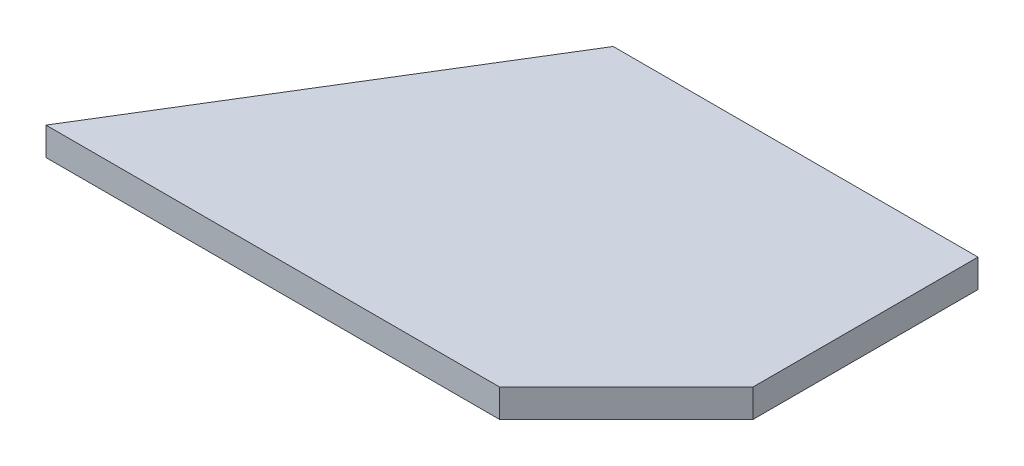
from build123d import *

# Parameters (mm, degrees)
BOSS_EXTRUDE1_DEPTH = 3.175


with BuildPart() as part:
    # Sketch1 → Boss-Extrude1 (new, symmetric)
    with BuildSketch(Plane(origin=(0, 0, 0), x_dir=(1, 0, 0), z_dir=(0, 1, 0))):
        Polygon((0, 0), (-82.327687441, 0), (-130.96875, -79.375), (-28.575, -79.375), (0, -50.8), align=None)
    extrude(amount=BOSS_EXTRUDE1_DEPTH, both=True)


solid = part.part
